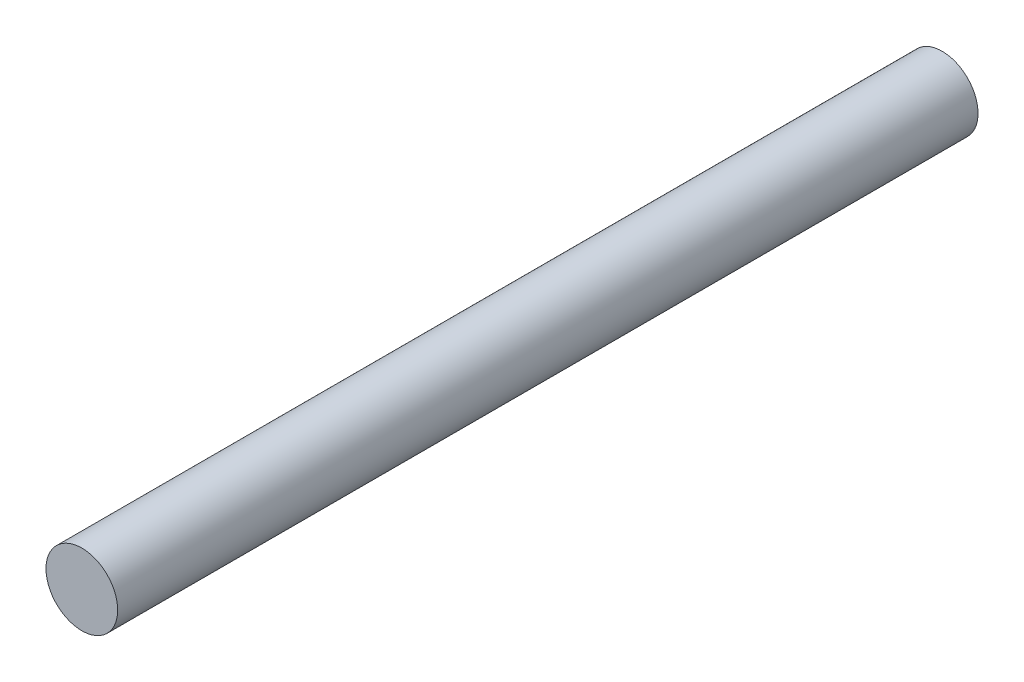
from build123d import *

# Parameters (mm, degrees)
SKETCH1_R          = 6.35
BASE_EXTRUDE_DEPTH = 152.4


with BuildPart() as part:
    # Sketch1 → Base-Extrude (new body)
    with BuildSketch(Plane.XY):
        with Locations(Location((0, 0, 0), (0, 0, 180))):
            Circle(SKETCH1_R)
    extrude(amount=BASE_EXTRUDE_DEPTH)


solid = part.part
